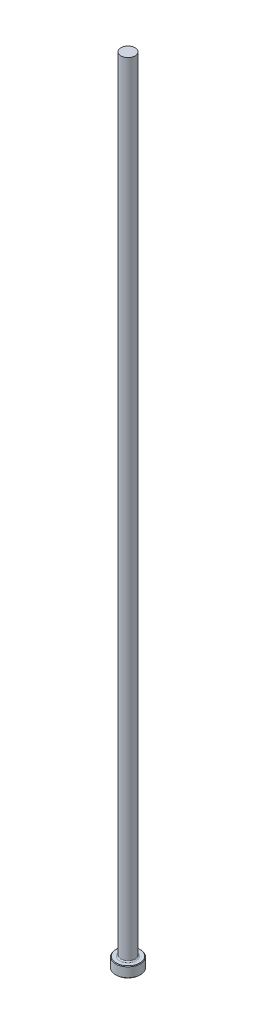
from build123d import *

# Parameters (mm, degrees)
CHAMFER1_SIZE = 0.254
FILLET1_R     = 0.508


with BuildPart() as part:
    # Sketch1 → Revolve1 (revolve)
    with BuildSketch(Plane.XY, mode=Mode.PRIVATE) as revolve1_sk:
        Polygon((0, 0), (-5.5499, 0), (-5.5499, 4.7498), (-3.175, 4.7498), (-3.175, 355.6), (0, 355.6), align=None)
    revolve(revolve1_sk.sketch.rotate(Axis((0, 259.958771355, 0), (0, -1, 0)), 270), axis=Axis((0, 259.958771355, 0), (0, -1, 0)))

    # Chamfer1
    chamfer1_edges = [part.edges().sort_by_distance(p)[0] for p in [
        (0, 4.7498, -5.5499),
        (0, 0, -5.5499),
    ]]
    chamfer(chamfer1_edges, length=CHAMFER1_SIZE)

    # Fillet1
    fillet1_edges = [part.edges().sort_by_distance(p)[0] for p in [
        (0, 4.7498, -3.175),
    ]]
    fillet(fillet1_edges, radius=FILLET1_R)


solid = part.part
